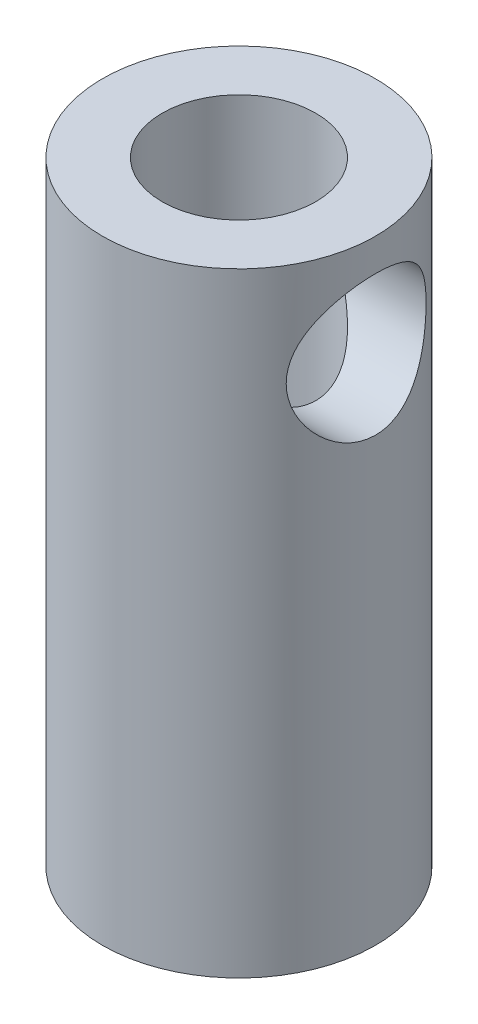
ISO-10303-21;
HEADER;
FILE_DESCRIPTION(('STEP AP214'),'2;1');
FILE_NAME('part.step','',(''),(''),'','','');
FILE_SCHEMA(('AUTOMOTIVE_DESIGN { 1 0 10303 214 1 1 1 1 }'));
ENDSEC;
DATA;
#1=APPLICATION_CONTEXT('core data for automotive mechanical design processes');
#2=APPLICATION_PROTOCOL_DEFINITION('international standard','automotive_design',2000,#1);
#3=PRODUCT_CONTEXT('',#1,'mechanical');
#4=PRODUCT('Part','Part','',(#3));
#5=PRODUCT_RELATED_PRODUCT_CATEGORY('part','',(#4));
#6=PRODUCT_DEFINITION_FORMATION('','',#4);
#7=PRODUCT_DEFINITION_CONTEXT('part definition',#1,'design');
#8=PRODUCT_DEFINITION('design','',#6,#7);
#9=PRODUCT_DEFINITION_SHAPE('','',#8);
#10=(LENGTH_UNIT() NAMED_UNIT(*) SI_UNIT(.MILLI.,.METRE.));
#11=(NAMED_UNIT(*) PLANE_ANGLE_UNIT() SI_UNIT($,.RADIAN.));
#12=(NAMED_UNIT(*) SI_UNIT($,.STERADIAN.) SOLID_ANGLE_UNIT());
#13=UNCERTAINTY_MEASURE_WITH_UNIT(LENGTH_MEASURE(1.E-05),#10,'distance_accuracy_value','');
#14=(GEOMETRIC_REPRESENTATION_CONTEXT(3) GLOBAL_UNCERTAINTY_ASSIGNED_CONTEXT((#13)) GLOBAL_UNIT_ASSIGNED_CONTEXT((#10,
#11,#12)) REPRESENTATION_CONTEXT('',''));
#15=CARTESIAN_POINT('',(0.,0.,0.));
#16=DIRECTION('',(0.,0.,1.));
#17=DIRECTION('',(1.,0.,0.));
#18=AXIS2_PLACEMENT_3D('',#15,#16,#17);
#19=CARTESIAN_POINT('',(0.,18.,0.));
#20=DIRECTION('',(0.,-1.,0.));
#21=DIRECTION('',(0.,0.,-1.));
#22=AXIS2_PLACEMENT_3D('',#19,#20,#21);
#23=CYLINDRICAL_SURFACE('',#22,4.);
#24=CARTESIAN_POINT('',(4.,12.95,0.));
#25=CARTESIAN_POINT('',(3.99999392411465,12.9500069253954,0.107446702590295));
#26=CARTESIAN_POINT('',(3.9956248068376,12.9584969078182,0.215011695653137));
#27=CARTESIAN_POINT('',(3.97857707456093,12.9920715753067,0.426941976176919));
#28=CARTESIAN_POINT('',(3.96588374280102,13.0171856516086,0.531301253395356));
#29=CARTESIAN_POINT('',(3.93351130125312,13.0827576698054,0.733435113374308));
#30=CARTESIAN_POINT('',(3.91385980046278,13.1231550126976,0.831233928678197));
#31=CARTESIAN_POINT('',(3.86935610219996,13.2178219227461,1.0185093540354));
#32=CARTESIAN_POINT('',(3.84450414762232,13.2720908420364,1.10798635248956));
#33=CARTESIAN_POINT('',(3.79003440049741,13.3968146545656,1.28238013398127));
#34=CARTESIAN_POINT('',(3.76021561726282,13.4680703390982,1.36666044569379));
#35=CARTESIAN_POINT('',(3.6997975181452,13.6230130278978,1.52266543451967));
#36=CARTESIAN_POINT('',(3.66919759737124,13.7067099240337,1.59438002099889));
#37=CARTESIAN_POINT('',(3.60775880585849,13.8924273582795,1.72916327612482));
#38=CARTESIAN_POINT('',(3.57710857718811,13.995390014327,1.79103018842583));
#39=CARTESIAN_POINT('',(3.52243514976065,14.2119803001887,1.89631016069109));
#40=CARTESIAN_POINT('',(3.49840705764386,14.3255999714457,1.93973685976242));
#41=CARTESIAN_POINT('',(3.46197649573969,14.5532429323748,2.00400041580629));
#42=CARTESIAN_POINT('',(3.4489538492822,14.6668181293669,2.02605450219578));
#43=CARTESIAN_POINT('',(3.43439428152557,14.8967398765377,2.05064985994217));
#44=CARTESIAN_POINT('',(3.43284492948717,15.0130832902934,2.05321224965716));
#45=CARTESIAN_POINT('',(3.44091328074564,15.2293028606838,2.03964223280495));
#46=CARTESIAN_POINT('',(3.44913535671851,15.3293909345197,2.0258467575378));
#47=CARTESIAN_POINT('',(3.47336062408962,15.5255655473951,1.98402224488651));
#48=CARTESIAN_POINT('',(3.48936651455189,15.6216506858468,1.95598827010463));
#49=CARTESIAN_POINT('',(3.5276948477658,15.8098365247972,1.88599690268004));
#50=CARTESIAN_POINT('',(3.55015478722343,15.9017937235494,1.8437325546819));
#51=CARTESIAN_POINT('',(3.59887608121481,16.0777623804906,1.746721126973));
#52=CARTESIAN_POINT('',(3.62513914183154,16.161770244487,1.69196843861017));
#53=CARTESIAN_POINT('',(3.6827593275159,16.3313166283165,1.56298108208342));
#54=CARTESIAN_POINT('',(3.71432725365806,16.4155493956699,1.48711841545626));
#55=CARTESIAN_POINT('',(3.77616205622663,16.5706572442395,1.32225338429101));
#56=CARTESIAN_POINT('',(3.80642824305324,16.6415253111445,1.23324416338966));
#57=CARTESIAN_POINT('',(3.86413082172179,16.771315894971,1.03887984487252));
#58=CARTESIAN_POINT('',(3.89134374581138,16.8294434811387,0.932922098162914));
#59=CARTESIAN_POINT('',(3.93793225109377,16.9265600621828,0.71098709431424));
#60=CARTESIAN_POINT('',(3.9573143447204,16.9655649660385,0.595018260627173));
#61=CARTESIAN_POINT('',(3.98464106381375,17.0199915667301,0.366983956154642));
#62=CARTESIAN_POINT('',(3.99342229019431,17.0371452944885,0.255433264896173));
#63=CARTESIAN_POINT('',(4.00145873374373,17.0528574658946,0.0307090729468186));
#64=CARTESIAN_POINT('',(4.00071881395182,17.0514254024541,-0.0824635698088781));
#65=CARTESIAN_POINT('',(3.99026748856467,17.0309592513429,-0.297297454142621));
#66=CARTESIAN_POINT('',(3.98129965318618,17.0133839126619,-0.399139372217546));
#67=CARTESIAN_POINT('',(3.95628799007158,16.9634612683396,-0.598208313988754));
#68=CARTESIAN_POINT('',(3.94024339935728,16.9311123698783,-0.695434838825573));
#69=CARTESIAN_POINT('',(3.90196747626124,16.8517796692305,-0.885620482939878));
#70=CARTESIAN_POINT('',(3.87957858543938,16.8044189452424,-0.978389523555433));
#71=CARTESIAN_POINT('',(3.83072816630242,16.6968422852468,-1.1549575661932));
#72=CARTESIAN_POINT('',(3.80426494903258,16.6366210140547,-1.23875282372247));
#73=CARTESIAN_POINT('',(3.74660367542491,16.4979690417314,-1.4040590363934));
#74=CARTESIAN_POINT('',(3.71519791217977,16.4183082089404,-1.48446743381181));
#75=CARTESIAN_POINT('',(3.65311227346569,16.2466486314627,-1.63129973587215));
#76=CARTESIAN_POINT('',(3.62243297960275,16.154640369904,-1.69771275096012));
#77=CARTESIAN_POINT('',(3.56356965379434,15.954543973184,-1.81816264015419));
#78=CARTESIAN_POINT('',(3.53561681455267,15.8458486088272,-1.87131407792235));
#79=CARTESIAN_POINT('',(3.48836409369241,15.619179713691,-1.95800598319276));
#80=CARTESIAN_POINT('',(3.46905256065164,15.5012189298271,-1.99157287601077));
#81=CARTESIAN_POINT('',(3.44377010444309,15.2716037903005,-2.03495016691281));
#82=CARTESIAN_POINT('',(3.43668429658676,15.1604520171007,-2.04675369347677));
#83=CARTESIAN_POINT('',(3.4335129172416,14.9375774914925,-2.05207421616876));
#84=CARTESIAN_POINT('',(3.43742170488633,14.8258550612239,-2.04560058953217));
#85=CARTESIAN_POINT('',(3.45459300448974,14.6173808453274,-2.01643624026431));
#86=CARTESIAN_POINT('',(3.46683362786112,14.5202861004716,-1.99551390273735));
#87=CARTESIAN_POINT('',(3.49802632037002,14.3311173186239,-1.94031204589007));
#88=CARTESIAN_POINT('',(3.51698064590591,14.2390449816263,-1.90602803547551));
#89=CARTESIAN_POINT('',(3.56099904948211,14.0557184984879,-1.82253889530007));
#90=CARTESIAN_POINT('',(3.58638613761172,13.9649278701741,-1.77249158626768));
#91=CARTESIAN_POINT('',(3.63991555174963,13.7924316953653,-1.65979102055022));
#92=CARTESIAN_POINT('',(3.66805933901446,13.7107310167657,-1.59713105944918));
#93=CARTESIAN_POINT('',(3.72830722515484,13.5476772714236,-1.45145088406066));
#94=CARTESIAN_POINT('',(3.76045063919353,13.4677494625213,-1.36684291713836));
#95=CARTESIAN_POINT('',(3.82177614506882,13.3228638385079,-1.1845953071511));
#96=CARTESIAN_POINT('',(3.85095653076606,13.2579146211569,-1.08694823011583));
#97=CARTESIAN_POINT('',(3.90362778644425,13.1443668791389,-0.87937418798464));
#98=CARTESIAN_POINT('',(3.92704031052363,13.0959903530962,-0.769304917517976));
#99=CARTESIAN_POINT('',(3.96489782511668,13.0190788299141,-0.541157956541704));
#100=CARTESIAN_POINT('',(3.97936775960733,12.9904886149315,-0.423103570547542));
#101=CARTESIAN_POINT('',(3.99230233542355,12.9650535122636,-0.253130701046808));
#102=CARTESIAN_POINT('',(3.99518057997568,12.9594173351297,-0.202722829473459));
#103=CARTESIAN_POINT('',(3.9990308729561,12.951888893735,-0.101552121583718));
#104=CARTESIAN_POINT('',(4.00000287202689,12.9499967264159,-0.0507892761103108));
#105=CARTESIAN_POINT('',(4.,12.95,0.));
#106=B_SPLINE_CURVE_WITH_KNOTS('',3,(#24,#25,#26,#27,#28,#29,#30,#31,#32,#33,#34,#35,#36,#37,
#38,#39,#40,#41,#42,#43,#44,#45,#46,#47,#48,#49,#50,#51,#52,#53,#54,#55,#56,#57,#58,#59,#60,#61,
#62,#63,#64,#65,#66,#67,#68,#69,#70,#71,#72,#73,#74,#75,#76,#77,#78,#79,#80,#81,#82,#83,#84,#85,
#86,#87,#88,#89,#90,#91,#92,#93,#94,#95,#96,#97,#98,#99,#100,#101,#102,#103,#104,#105),
.UNSPECIFIED.,.T.,.F.,(4,2,2,2,2,2,2,2,2,2,2,2,2,2,2,2,2,2,2,2,2,2,2,2,2,2,2,2,2,2,2,2,2,2,2,2,
2,2,2,2,4),(0.,0.322134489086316,0.644840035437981,0.966279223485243,1.28770340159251,
1.62925613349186,1.97108189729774,2.34111430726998,2.71087254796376,3.05805757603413,
3.40486639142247,3.70755320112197,4.01034504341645,4.32013817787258,4.63007071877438,
4.98156987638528,5.33325300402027,5.70289727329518,6.07223349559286,6.409973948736,
6.74754190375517,7.05732039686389,7.36713229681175,7.68543814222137,8.00387629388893,
8.35475819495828,8.70591211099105,9.07644812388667,9.44648301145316,9.78052619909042,
10.1143980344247,10.4133231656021,10.7123488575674,11.0313041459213,11.3504294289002,
11.7110310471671,12.0718391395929,12.4373069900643,12.8017507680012,12.9540174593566,
13.1062880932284),.UNSPECIFIED.);
#107=CARTESIAN_POINT('',(4.,12.95,0.));
#108=VERTEX_POINT('',#107);
#109=EDGE_CURVE('E10',#108,#108,#106,.T.);
#110=ORIENTED_EDGE('',*,*,#109,.T.);
#111=EDGE_LOOP('',(#110));
#112=FACE_BOUND('',#111,.T.);
#113=CARTESIAN_POINT('',(0.,18.,0.));
#114=DIRECTION('',(0.,1.,0.));
#115=DIRECTION('',(0.,0.,1.));
#116=AXIS2_PLACEMENT_3D('',#113,#114,#115);
#117=CIRCLE('',#116,4.);
#118=CARTESIAN_POINT('',(0.,18.,4.));
#119=VERTEX_POINT('',#118);
#120=EDGE_CURVE('E42',#119,#119,#117,.T.);
#121=ORIENTED_EDGE('',*,*,#120,.F.);
#122=EDGE_LOOP('',(#121));
#123=FACE_BOUND('',#122,.T.);
#124=CARTESIAN_POINT('',(0.,0.,0.));
#125=DIRECTION('',(0.,1.,0.));
#126=DIRECTION('',(0.,0.,1.));
#127=AXIS2_PLACEMENT_3D('',#124,#125,#126);
#128=CIRCLE('',#127,4.);
#129=CARTESIAN_POINT('',(0.,0.,4.));
#130=VERTEX_POINT('',#129);
#131=EDGE_CURVE('E46',#130,#130,#128,.T.);
#132=ORIENTED_EDGE('',*,*,#131,.T.);
#133=EDGE_LOOP('',(#132));
#134=FACE_BOUND('',#133,.T.);
#135=ADVANCED_FACE('F32',(#112,#123,#134),#23,.T.);
#136=CARTESIAN_POINT('',(0.,18.,0.));
#137=DIRECTION('',(0.,1.,0.));
#138=DIRECTION('',(0.,0.,1.));
#139=AXIS2_PLACEMENT_3D('',#136,#137,#138);
#140=PLANE('',#139);
#141=CARTESIAN_POINT('',(0.,18.,0.));
#142=DIRECTION('',(0.,-1.,0.));
#143=DIRECTION('',(0.,0.,-1.));
#144=AXIS2_PLACEMENT_3D('',#141,#142,#143);
#145=CIRCLE('',#144,2.25);
#146=CARTESIAN_POINT('',(0.,18.,-2.25));
#147=VERTEX_POINT('',#146);
#148=EDGE_CURVE('E51',#147,#147,#145,.T.);
#149=ORIENTED_EDGE('',*,*,#148,.T.);
#150=EDGE_LOOP('',(#149));
#151=FACE_BOUND('',#150,.T.);
#152=ORIENTED_EDGE('',*,*,#120,.T.);
#153=EDGE_LOOP('',(#152));
#154=FACE_BOUND('',#153,.T.);
#155=ADVANCED_FACE('F78',(#151,#154),#140,.T.);
#156=CARTESIAN_POINT('',(0.,0.,0.));
#157=DIRECTION('',(0.,1.,0.));
#158=DIRECTION('',(0.,0.,1.));
#159=AXIS2_PLACEMENT_3D('',#156,#157,#158);
#160=PLANE('',#159);
#161=CARTESIAN_POINT('',(0.,0.,0.));
#162=DIRECTION('',(0.,-1.,0.));
#163=DIRECTION('',(0.,0.,-1.));
#164=AXIS2_PLACEMENT_3D('',#161,#162,#163);
#165=CIRCLE('',#164,2.25);
#166=CARTESIAN_POINT('',(0.,0.,-2.25));
#167=VERTEX_POINT('',#166);
#168=EDGE_CURVE('E53',#167,#167,#165,.T.);
#169=ORIENTED_EDGE('',*,*,#168,.F.);
#170=EDGE_LOOP('',(#169));
#171=FACE_BOUND('',#170,.T.);
#172=ORIENTED_EDGE('',*,*,#131,.F.);
#173=EDGE_LOOP('',(#172));
#174=FACE_BOUND('',#173,.T.);
#175=ADVANCED_FACE('F74',(#171,#174),#160,.F.);
#176=CARTESIAN_POINT('',(0.,18.,0.));
#177=DIRECTION('',(0.,-1.,0.));
#178=DIRECTION('',(0.,0.,-1.));
#179=AXIS2_PLACEMENT_3D('',#176,#177,#178);
#180=CYLINDRICAL_SURFACE('',#179,2.25);
#181=CARTESIAN_POINT('',(0.927361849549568,15.,2.05));
#182=CARTESIAN_POINT('',(0.927379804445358,14.9407227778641,2.04999506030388));
#183=CARTESIAN_POINT('',(0.933194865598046,14.8814062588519,2.04739011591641));
#184=CARTESIAN_POINT('',(0.954930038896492,14.7650176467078,2.03733560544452));
#185=CARTESIAN_POINT('',(0.970890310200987,14.707955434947,2.02986678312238));
#186=CARTESIAN_POINT('',(1.01948424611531,14.5693417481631,2.00603557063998));
#187=CARTESIAN_POINT('',(1.05646499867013,14.4898325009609,1.98709267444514));
#188=CARTESIAN_POINT('',(1.13806758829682,14.3371486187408,1.94152373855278));
#189=CARTESIAN_POINT('',(1.18272021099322,14.2640013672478,1.91486643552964));
#190=CARTESIAN_POINT('',(1.27015742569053,14.1308033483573,1.85785487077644));
#191=CARTESIAN_POINT('',(1.31259584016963,14.0702014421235,1.82824343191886));
#192=CARTESIAN_POINT('',(1.39835567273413,13.9526141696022,1.76351684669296));
#193=CARTESIAN_POINT('',(1.44167766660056,13.8956312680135,1.7283980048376));
#194=CARTESIAN_POINT('',(1.52788847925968,13.7852475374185,1.65267828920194));
#195=CARTESIAN_POINT('',(1.57077784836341,13.7318414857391,1.61208568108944));
#196=CARTESIAN_POINT('',(1.65520553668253,13.6286568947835,1.52527486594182));
#197=CARTESIAN_POINT('',(1.69674378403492,13.5788785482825,1.47905636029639));
#198=CARTESIAN_POINT('',(1.79787287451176,13.459278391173,1.35619873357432));
#199=CARTESIAN_POINT('',(1.85606927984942,13.3919252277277,1.27592830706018));
#200=CARTESIAN_POINT('',(1.96411975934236,13.2683376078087,1.10233908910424));
#201=CARTESIAN_POINT('',(2.01398826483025,13.2120838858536,1.00904339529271));
#202=CARTESIAN_POINT('',(2.09311013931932,13.1234545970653,0.830036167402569));
#203=CARTESIAN_POINT('',(2.12449152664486,13.0885540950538,0.746528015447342));
#204=CARTESIAN_POINT('',(2.17773707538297,13.0295428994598,0.572876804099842));
#205=CARTESIAN_POINT('',(2.19960689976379,13.0054257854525,0.48273773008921));
#206=CARTESIAN_POINT('',(2.23224938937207,12.9694841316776,0.297422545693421));
#207=CARTESIAN_POINT('',(2.24295090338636,12.9577384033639,0.202218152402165));
#208=CARTESIAN_POINT('',(2.25201741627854,12.9477848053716,0.0105253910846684));
#209=CARTESIAN_POINT('',(2.25038718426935,12.9495717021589,-0.0859624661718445));
#210=CARTESIAN_POINT('',(2.23576862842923,12.9656278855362,-0.266880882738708));
#211=CARTESIAN_POINT('',(2.22396555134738,12.9785946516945,-0.351530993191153));
#212=CARTESIAN_POINT('',(2.19144210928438,13.0144333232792,-0.516901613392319));
#213=CARTESIAN_POINT('',(2.1707200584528,13.0373071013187,-0.597621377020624));
#214=CARTESIAN_POINT('',(2.12043997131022,13.0930605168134,-0.757355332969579));
#215=CARTESIAN_POINT('',(2.09050181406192,13.1263719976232,-0.836096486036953));
#216=CARTESIAN_POINT('',(2.02386415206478,13.2010257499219,-0.986536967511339));
#217=CARTESIAN_POINT('',(1.98716200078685,13.2423711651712,-1.05823352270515));
#218=CARTESIAN_POINT('',(1.88784675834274,13.355302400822,-1.23000003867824));
#219=CARTESIAN_POINT('',(1.82176442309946,13.4313498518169,-1.32513804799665));
#220=CARTESIAN_POINT('',(1.68227406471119,13.5957246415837,-1.49828441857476));
#221=CARTESIAN_POINT('',(1.60884136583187,13.6840937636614,-1.57623206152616));
#222=CARTESIAN_POINT('',(1.49607295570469,13.8256674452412,-1.68136891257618));
#223=CARTESIAN_POINT('',(1.45755479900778,13.8750294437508,-1.71478612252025));
#224=CARTESIAN_POINT('',(1.38069321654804,13.9765637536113,-1.77725457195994));
#225=CARTESIAN_POINT('',(1.3423497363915,14.0287351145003,-1.80630727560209));
#226=CARTESIAN_POINT('',(1.26693265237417,14.1359571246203,-1.85997768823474));
#227=CARTESIAN_POINT('',(1.22985605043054,14.191000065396,-1.88460655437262));
#228=CARTESIAN_POINT('',(1.15835827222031,14.3044841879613,-1.92937199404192));
#229=CARTESIAN_POINT('',(1.12393393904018,14.3629211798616,-1.94951396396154));
#230=CARTESIAN_POINT('',(1.06490320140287,14.4747235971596,-1.98228232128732));
#231=CARTESIAN_POINT('',(1.03959959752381,14.5275140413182,-1.99558524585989));
#232=CARTESIAN_POINT('',(0.994891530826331,14.6363315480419,-2.01824657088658));
#233=CARTESIAN_POINT('',(0.975474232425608,14.6923512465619,-2.02761357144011));
#234=CARTESIAN_POINT('',(0.947989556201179,14.7979423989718,-2.04059144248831));
#235=CARTESIAN_POINT('',(0.938583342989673,14.8470653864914,-2.04489421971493));
#236=CARTESIAN_POINT('',(0.927611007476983,14.9463398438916,-2.04989742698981));
#237=CARTESIAN_POINT('',(0.926032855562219,14.9964896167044,-2.05060338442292));
#238=CARTESIAN_POINT('',(0.931007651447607,15.0962435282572,-2.04834776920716));
#239=CARTESIAN_POINT('',(0.937555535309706,15.1458479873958,-2.04538848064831));
#240=CARTESIAN_POINT('',(0.957561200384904,15.2433402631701,-2.03609808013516));
#241=CARTESIAN_POINT('',(0.971033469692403,15.2912242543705,-2.02975989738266));
#242=CARTESIAN_POINT('',(1.01455154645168,15.4184127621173,-2.0085065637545));
#243=CARTESIAN_POINT('',(1.04954415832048,15.4954889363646,-1.99070212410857));
#244=CARTESIAN_POINT('',(1.12708754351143,15.6436886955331,-1.94786038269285));
#245=CARTESIAN_POINT('',(1.16967332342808,15.7147823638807,-1.9227892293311));
#246=CARTESIAN_POINT('',(1.25444154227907,15.8461015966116,-1.8684751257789));
#247=CARTESIAN_POINT('',(1.29634466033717,15.9067361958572,-1.83977520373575));
#248=CARTESIAN_POINT('',(1.38120890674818,16.0244015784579,-1.77695078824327));
#249=CARTESIAN_POINT('',(1.42417077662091,16.081429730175,-1.74282239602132));
#250=CARTESIAN_POINT('',(1.5098235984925,16.1919648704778,-1.66916778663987));
#251=CARTESIAN_POINT('',(1.55251482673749,16.2454762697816,-1.62964852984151));
#252=CARTESIAN_POINT('',(1.63669901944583,16.3489571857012,-1.54508217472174));
#253=CARTESIAN_POINT('',(1.67819188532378,16.3989264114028,-1.50003462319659));
#254=CARTESIAN_POINT('',(1.780768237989,16.5207659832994,-1.3786315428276));
#255=CARTESIAN_POINT('',(1.84045825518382,16.5900533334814,-1.29841872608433));
#256=CARTESIAN_POINT('',(1.95154037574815,16.7174009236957,-1.12454360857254));
#257=CARTESIAN_POINT('',(2.0029475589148,16.7754816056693,-1.03090634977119));
#258=CARTESIAN_POINT('',(2.08447287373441,16.8669118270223,-0.85151423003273));
#259=CARTESIAN_POINT('',(2.11679505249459,16.9028914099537,-0.768114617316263));
#260=CARTESIAN_POINT('',(2.17195901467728,16.9640727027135,-0.594452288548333));
#261=CARTESIAN_POINT('',(2.19480631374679,16.9892806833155,-0.504193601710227));
#262=CARTESIAN_POINT('',(2.22938130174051,17.0273641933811,-0.318341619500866));
#263=CARTESIAN_POINT('',(2.24103429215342,17.0401568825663,-0.222716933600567));
#264=CARTESIAN_POINT('',(2.25186813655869,17.0520518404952,-0.0299246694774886));
#265=CARTESIAN_POINT('',(2.25105456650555,17.0511602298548,0.0672421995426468));
#266=CARTESIAN_POINT('',(2.23781691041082,17.0366224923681,0.249198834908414));
#267=CARTESIAN_POINT('',(2.22664719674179,17.0243543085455,0.334198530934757));
#268=CARTESIAN_POINT('',(2.19528358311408,16.9898046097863,0.500384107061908));
#269=CARTESIAN_POINT('',(2.17508813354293,16.9675213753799,0.58156932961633));
#270=CARTESIAN_POINT('',(2.12591535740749,16.9130238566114,0.741828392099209));
#271=CARTESIAN_POINT('',(2.0966027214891,16.8804293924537,0.820667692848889));
#272=CARTESIAN_POINT('',(2.03116224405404,16.8071773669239,0.971413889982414));
#273=CARTESIAN_POINT('',(1.99503145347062,16.7665163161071,1.04331776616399));
#274=CARTESIAN_POINT('',(1.8972969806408,16.655521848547,1.21532037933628));
#275=CARTESIAN_POINT('',(1.83222674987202,16.5807635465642,1.31060076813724));
#276=CARTESIAN_POINT('',(1.69464517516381,16.4190407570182,1.48424709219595));
#277=CARTESIAN_POINT('',(1.62211099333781,16.3320384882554,1.56255869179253));
#278=CARTESIAN_POINT('',(1.51051203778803,16.1926565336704,1.66840449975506));
#279=CARTESIAN_POINT('',(1.47236763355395,16.1440729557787,1.70208247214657));
#280=CARTESIAN_POINT('',(1.39614109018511,16.0441551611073,1.76514375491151));
#281=CARTESIAN_POINT('',(1.35805893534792,15.9928218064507,1.79452840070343));
#282=CARTESIAN_POINT('',(1.28295245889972,15.8873221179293,1.84896701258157));
#283=CARTESIAN_POINT('',(1.24592644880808,15.8331607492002,1.87402825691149));
#284=CARTESIAN_POINT('',(1.17423369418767,15.7215659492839,1.91975941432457));
#285=CARTESIAN_POINT('',(1.13956455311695,15.6641359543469,1.94043383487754));
#286=CARTESIAN_POINT('',(1.07704204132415,15.5496832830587,1.97577132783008));
#287=CARTESIAN_POINT('',(1.04887579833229,15.492937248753,1.99076317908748));
#288=CARTESIAN_POINT('',(0.999170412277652,15.3756785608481,2.01616915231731));
#289=CARTESIAN_POINT('',(0.977610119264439,15.3151786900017,2.02659793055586));
#290=CARTESIAN_POINT('',(0.950434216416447,15.211868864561,2.03944167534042));
#291=CARTESIAN_POINT('',(0.941889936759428,15.1700353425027,2.04337566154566));
#292=CARTESIAN_POINT('',(0.930350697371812,15.0854739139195,2.04865501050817));
#293=CARTESIAN_POINT('',(0.927348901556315,15.04274717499,2.05000356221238));
#294=CARTESIAN_POINT('',(0.927361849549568,15.,2.05));
#295=B_SPLINE_CURVE_WITH_KNOTS('',3,(#181,#182,#183,#184,#185,#186,#187,#188,#189,#190,#191,
#192,#193,#194,#195,#196,#197,#198,#199,#200,#201,#202,#203,#204,#205,#206,#207,#208,#209,#210,
#211,#212,#213,#214,#215,#216,#217,#218,#219,#220,#221,#222,#223,#224,#225,#226,#227,#228,#229,
#230,#231,#232,#233,#234,#235,#236,#237,#238,#239,#240,#241,#242,#243,#244,#245,#246,#247,#248,
#249,#250,#251,#252,#253,#254,#255,#256,#257,#258,#259,#260,#261,#262,#263,#264,#265,#266,#267,
#268,#269,#270,#271,#272,#273,#274,#275,#276,#277,#278,#279,#280,#281,#282,#283,#284,#285,#286,
#287,#288,#289,#290,#291,#292,#293,#294),.UNSPECIFIED.,.T.,.F.,(4,2,2,2,2,2,2,2,2,2,2,2,2,2,2,2,
2,2,2,2,2,2,2,2,2,2,2,2,2,2,2,2,2,2,2,2,2,2,2,2,2,2,2,2,2,2,2,2,2,2,2,2,2,2,2,2,4),(0.,
0.177621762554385,0.355951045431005,0.623561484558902,0.892272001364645,1.13104354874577,
1.36997600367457,1.60855161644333,1.84713989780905,2.20538881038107,2.56301032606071,
2.84924739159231,3.13531380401,3.42319176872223,3.71095840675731,3.9691326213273,
4.22735565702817,4.49811458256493,4.76897967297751,5.18243283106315,5.59732375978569,
5.81008714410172,6.02277899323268,6.2349266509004,6.44681776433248,6.62657280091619,
6.80593299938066,6.95588906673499,7.1056146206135,7.25524691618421,7.40519357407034,
7.66321382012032,7.92245590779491,8.15943902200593,8.39659311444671,8.63344385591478,
8.87031402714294,9.23389213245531,9.59680063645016,9.88488580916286,10.1728030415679,
10.4626284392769,10.752324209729,11.0109553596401,11.2696309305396,11.5392474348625,
11.8089808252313,12.2191887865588,12.6306914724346,12.8416031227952,13.0524490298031,
13.2629364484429,13.4732065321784,13.6681181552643,13.8623990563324,13.9906474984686,
14.1187376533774),.UNSPECIFIED.);
#296=CARTESIAN_POINT('',(0.927361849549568,15.,2.05));
#297=VERTEX_POINT('',#296);
#298=EDGE_CURVE('E56',#297,#297,#295,.T.);
#299=ORIENTED_EDGE('',*,*,#298,.T.);
#300=EDGE_LOOP('',(#299));
#301=FACE_BOUND('',#300,.T.);
#302=ORIENTED_EDGE('',*,*,#148,.F.);
#303=EDGE_LOOP('',(#302));
#304=FACE_BOUND('',#303,.T.);
#305=ORIENTED_EDGE('',*,*,#168,.T.);
#306=EDGE_LOOP('',(#305));
#307=FACE_BOUND('',#306,.T.);
#308=ADVANCED_FACE('F63',(#301,#304,#307),#180,.F.);
#309=CARTESIAN_POINT('',(0.,15.,0.));
#310=DIRECTION('',(-1.,0.,0.));
#311=DIRECTION('',(0.,0.,1.));
#312=AXIS2_PLACEMENT_3D('',#309,#310,#311);
#313=CYLINDRICAL_SURFACE('',#312,2.05);
#314=ORIENTED_EDGE('',*,*,#109,.F.);
#315=EDGE_LOOP('',(#314));
#316=FACE_BOUND('',#315,.T.);
#317=ORIENTED_EDGE('',*,*,#298,.F.);
#318=EDGE_LOOP('',(#317));
#319=FACE_BOUND('',#318,.T.);
#320=ADVANCED_FACE('F66',(#316,#319),#313,.F.);
#321=CLOSED_SHELL('',(#135,#155,#175,#308,#320));
#322=MANIFOLD_SOLID_BREP('B2',#321);
#323=ADVANCED_BREP_SHAPE_REPRESENTATION('',(#18,#322),#14);
#324=SHAPE_DEFINITION_REPRESENTATION(#9,#323);
ENDSEC;
END-ISO-10303-21;
